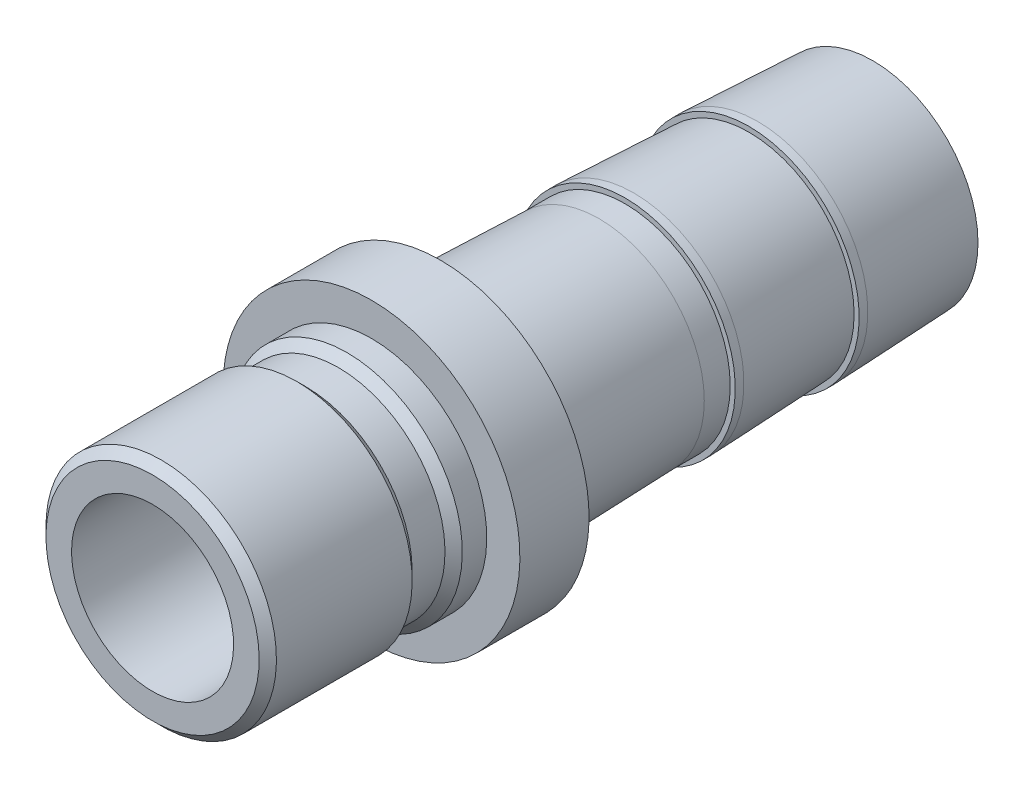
ISO-10303-21;
HEADER;
FILE_DESCRIPTION(('STEP AP214'),'2;1');
FILE_NAME('part.step','',(''),(''),'','','');
FILE_SCHEMA(('AUTOMOTIVE_DESIGN { 1 0 10303 214 1 1 1 1 }'));
ENDSEC;
DATA;
#1=APPLICATION_CONTEXT('core data for automotive mechanical design processes');
#2=APPLICATION_PROTOCOL_DEFINITION('international standard','automotive_design',2000,#1);
#3=PRODUCT_CONTEXT('',#1,'mechanical');
#4=PRODUCT('Part','Part','',(#3));
#5=PRODUCT_RELATED_PRODUCT_CATEGORY('part','',(#4));
#6=PRODUCT_DEFINITION_FORMATION('','',#4);
#7=PRODUCT_DEFINITION_CONTEXT('part definition',#1,'design');
#8=PRODUCT_DEFINITION('design','',#6,#7);
#9=PRODUCT_DEFINITION_SHAPE('','',#8);
#10=(LENGTH_UNIT() NAMED_UNIT(*) SI_UNIT(.MILLI.,.METRE.));
#11=(NAMED_UNIT(*) PLANE_ANGLE_UNIT() SI_UNIT($,.RADIAN.));
#12=(NAMED_UNIT(*) SI_UNIT($,.STERADIAN.) SOLID_ANGLE_UNIT());
#13=UNCERTAINTY_MEASURE_WITH_UNIT(LENGTH_MEASURE(1.E-05),#10,'distance_accuracy_value','');
#14=(GEOMETRIC_REPRESENTATION_CONTEXT(3) GLOBAL_UNCERTAINTY_ASSIGNED_CONTEXT((#13)) GLOBAL_UNIT_ASSIGNED_CONTEXT((#10,
#11,#12)) REPRESENTATION_CONTEXT('',''));
#15=CARTESIAN_POINT('',(0.,0.,0.));
#16=DIRECTION('',(0.,0.,1.));
#17=DIRECTION('',(1.,0.,0.));
#18=AXIS2_PLACEMENT_3D('',#15,#16,#17);
#19=CARTESIAN_POINT('',(0.,0.,0.));
#20=DIRECTION('',(0.,0.,-1.));
#21=DIRECTION('',(0.,1.,0.));
#22=AXIS2_PLACEMENT_3D('',#19,#20,#21);
#23=CYLINDRICAL_SURFACE('',#22,9.7155);
#24=CARTESIAN_POINT('',(0.,0.,-22.352));
#25=DIRECTION('',(0.,0.,-1.));
#26=DIRECTION('',(0.,1.,0.));
#27=AXIS2_PLACEMENT_3D('',#24,#25,#26);
#28=CIRCLE('',#27,9.7155);
#29=CARTESIAN_POINT('',(0.,9.7155,-22.352));
#30=VERTEX_POINT('',#29);
#31=EDGE_CURVE('E10',#30,#30,#28,.T.);
#32=ORIENTED_EDGE('',*,*,#31,.T.);
#33=EDGE_LOOP('',(#32));
#34=FACE_BOUND('',#33,.T.);
#35=CARTESIAN_POINT('',(0.,0.,-23.114));
#36=DIRECTION('',(0.,0.,-1.));
#37=DIRECTION('',(0.,1.,0.));
#38=AXIS2_PLACEMENT_3D('',#35,#36,#37);
#39=CIRCLE('',#38,9.7155);
#40=CARTESIAN_POINT('',(0.,9.7155,-23.114));
#41=VERTEX_POINT('',#40);
#42=EDGE_CURVE('E95',#41,#41,#39,.T.);
#43=ORIENTED_EDGE('',*,*,#42,.F.);
#44=EDGE_LOOP('',(#43));
#45=FACE_BOUND('',#44,.T.);
#46=ADVANCED_FACE('F31',(#34,#45),#23,.T.);
#47=CARTESIAN_POINT('',(0.,9.27099999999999,-22.352));
#48=DIRECTION('',(0.,0.,1.));
#49=DIRECTION('',(0.,-1.,0.));
#50=AXIS2_PLACEMENT_3D('',#47,#48,#49);
#51=PLANE('',#50);
#52=CARTESIAN_POINT('',(0.,0.,-22.352));
#53=DIRECTION('',(0.,0.,-1.));
#54=DIRECTION('',(0.,1.,0.));
#55=AXIS2_PLACEMENT_3D('',#52,#53,#54);
#56=CIRCLE('',#55,9.27099999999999);
#57=CARTESIAN_POINT('',(0.,9.27099999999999,-22.352));
#58=VERTEX_POINT('',#57);
#59=EDGE_CURVE('E37',#58,#58,#56,.T.);
#60=ORIENTED_EDGE('',*,*,#59,.T.);
#61=EDGE_LOOP('',(#60));
#62=FACE_BOUND('',#61,.T.);
#63=ORIENTED_EDGE('',*,*,#31,.F.);
#64=EDGE_LOOP('',(#63));
#65=FACE_BOUND('',#64,.T.);
#66=ADVANCED_FACE('F103',(#62,#65),#51,.T.);
#67=CARTESIAN_POINT('',(0.,0.,0.));
#68=DIRECTION('',(0.,0.,-1.));
#69=DIRECTION('',(0.,1.,0.));
#70=AXIS2_PLACEMENT_3D('',#67,#68,#69);
#71=CYLINDRICAL_SURFACE('',#70,9.27099999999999);
#72=CARTESIAN_POINT('',(0.,0.,-20.066));
#73=DIRECTION('',(0.,0.,-1.));
#74=DIRECTION('',(0.,1.,0.));
#75=AXIS2_PLACEMENT_3D('',#72,#73,#74);
#76=CIRCLE('',#75,9.27099999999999);
#77=CARTESIAN_POINT('',(0.,9.27099999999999,-20.066));
#78=VERTEX_POINT('',#77);
#79=EDGE_CURVE('E41',#78,#78,#76,.T.);
#80=ORIENTED_EDGE('',*,*,#79,.T.);
#81=EDGE_LOOP('',(#80));
#82=FACE_BOUND('',#81,.T.);
#83=ORIENTED_EDGE('',*,*,#59,.F.);
#84=EDGE_LOOP('',(#83));
#85=FACE_BOUND('',#84,.T.);
#86=ADVANCED_FACE('F107',(#82,#85),#71,.T.);
#87=CARTESIAN_POINT('',(0.,0.,-20.066));
#88=DIRECTION('',(0.,0.,1.));
#89=DIRECTION('',(0.,-1.,0.));
#90=AXIS2_PLACEMENT_3D('',#87,#88,#89);
#91=CONICAL_SURFACE('',#90,9.27099999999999,0.0318074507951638);
#92=CARTESIAN_POINT('',(0.,0.,-6.09600000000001));
#93=DIRECTION('',(0.,0.,-1.));
#94=DIRECTION('',(0.,1.,0.));
#95=AXIS2_PLACEMENT_3D('',#92,#93,#94);
#96=CIRCLE('',#95,9.7155);
#97=CARTESIAN_POINT('',(0.,9.7155,-6.096));
#98=VERTEX_POINT('',#97);
#99=EDGE_CURVE('E45',#98,#98,#96,.T.);
#100=ORIENTED_EDGE('',*,*,#99,.T.);
#101=EDGE_LOOP('',(#100));
#102=FACE_BOUND('',#101,.T.);
#103=ORIENTED_EDGE('',*,*,#79,.F.);
#104=EDGE_LOOP('',(#103));
#105=FACE_BOUND('',#104,.T.);
#106=ADVANCED_FACE('F111',(#102,#105),#91,.T.);
#107=CARTESIAN_POINT('',(0.,13.081,-6.096));
#108=DIRECTION('',(0.,0.,-1.));
#109=DIRECTION('',(0.,1.,0.));
#110=AXIS2_PLACEMENT_3D('',#107,#108,#109);
#111=PLANE('',#110);
#112=CARTESIAN_POINT('',(0.,0.,-6.09600000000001));
#113=DIRECTION('',(0.,0.,-1.));
#114=DIRECTION('',(0.,1.,0.));
#115=AXIS2_PLACEMENT_3D('',#112,#113,#114);
#116=CIRCLE('',#115,13.081);
#117=CARTESIAN_POINT('',(0.,13.081,-6.096));
#118=VERTEX_POINT('',#117);
#119=EDGE_CURVE('E50',#118,#118,#116,.T.);
#120=ORIENTED_EDGE('',*,*,#119,.T.);
#121=EDGE_LOOP('',(#120));
#122=FACE_BOUND('',#121,.T.);
#123=ORIENTED_EDGE('',*,*,#99,.F.);
#124=EDGE_LOOP('',(#123));
#125=FACE_BOUND('',#124,.T.);
#126=ADVANCED_FACE('F118',(#122,#125),#111,.T.);
#127=CARTESIAN_POINT('',(0.,0.,0.));
#128=DIRECTION('',(0.,0.,-1.));
#129=DIRECTION('',(0.,1.,0.));
#130=AXIS2_PLACEMENT_3D('',#127,#128,#129);
#131=CYLINDRICAL_SURFACE('',#130,13.081);
#132=CARTESIAN_POINT('',(0.,0.,0.));
#133=DIRECTION('',(0.,0.,-1.));
#134=DIRECTION('',(0.,1.,0.));
#135=AXIS2_PLACEMENT_3D('',#132,#133,#134);
#136=CIRCLE('',#135,13.081);
#137=CARTESIAN_POINT('',(0.,13.081,0.));
#138=VERTEX_POINT('',#137);
#139=EDGE_CURVE('E53',#138,#138,#136,.T.);
#140=ORIENTED_EDGE('',*,*,#139,.T.);
#141=EDGE_LOOP('',(#140));
#142=FACE_BOUND('',#141,.T.);
#143=ORIENTED_EDGE('',*,*,#119,.F.);
#144=EDGE_LOOP('',(#143));
#145=FACE_BOUND('',#144,.T.);
#146=ADVANCED_FACE('F122',(#142,#145),#131,.T.);
#147=CARTESIAN_POINT('',(0.,10.16,0.));
#148=DIRECTION('',(0.,0.,1.));
#149=DIRECTION('',(0.,-1.,0.));
#150=AXIS2_PLACEMENT_3D('',#147,#148,#149);
#151=PLANE('',#150);
#152=CARTESIAN_POINT('',(0.,0.,0.));
#153=DIRECTION('',(0.,0.,-1.));
#154=DIRECTION('',(0.,1.,0.));
#155=AXIS2_PLACEMENT_3D('',#152,#153,#154);
#156=CIRCLE('',#155,10.16);
#157=CARTESIAN_POINT('',(0.,10.16,0.));
#158=VERTEX_POINT('',#157);
#159=EDGE_CURVE('E56',#158,#158,#156,.T.);
#160=ORIENTED_EDGE('',*,*,#159,.T.);
#161=EDGE_LOOP('',(#160));
#162=FACE_BOUND('',#161,.T.);
#163=ORIENTED_EDGE('',*,*,#139,.F.);
#164=EDGE_LOOP('',(#163));
#165=FACE_BOUND('',#164,.T.);
#166=ADVANCED_FACE('F126',(#162,#165),#151,.T.);
#167=CARTESIAN_POINT('',(0.,0.,0.));
#168=DIRECTION('',(0.,0.,-1.));
#169=DIRECTION('',(0.,1.,0.));
#170=AXIS2_PLACEMENT_3D('',#167,#168,#169);
#171=CYLINDRICAL_SURFACE('',#170,10.16);
#172=CARTESIAN_POINT('',(0.,0.,2.15899999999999));
#173=DIRECTION('',(0.,0.,-1.));
#174=DIRECTION('',(0.,1.,0.));
#175=AXIS2_PLACEMENT_3D('',#172,#173,#174);
#176=CIRCLE('',#175,10.16);
#177=CARTESIAN_POINT('',(0.,10.16,2.15899999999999));
#178=VERTEX_POINT('',#177);
#179=EDGE_CURVE('E59',#178,#178,#176,.T.);
#180=ORIENTED_EDGE('',*,*,#179,.T.);
#181=EDGE_LOOP('',(#180));
#182=FACE_BOUND('',#181,.T.);
#183=ORIENTED_EDGE('',*,*,#159,.F.);
#184=EDGE_LOOP('',(#183));
#185=FACE_BOUND('',#184,.T.);
#186=ADVANCED_FACE('F130',(#182,#185),#171,.T.);
#187=CARTESIAN_POINT('',(0.,0.,2.15899999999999));
#188=DIRECTION('',(0.,0.,-1.));
#189=DIRECTION('',(0.,1.,0.));
#190=AXIS2_PLACEMENT_3D('',#187,#188,#189);
#191=CONICAL_SURFACE('',#190,10.16,0.785398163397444);
#192=CARTESIAN_POINT('',(0.,0.,2.921));
#193=DIRECTION('',(0.,0.,-1.));
#194=DIRECTION('',(0.,1.,0.));
#195=AXIS2_PLACEMENT_3D('',#192,#193,#194);
#196=CIRCLE('',#195,9.398);
#197=CARTESIAN_POINT('',(0.,9.398,2.921));
#198=VERTEX_POINT('',#197);
#199=EDGE_CURVE('E62',#198,#198,#196,.T.);
#200=ORIENTED_EDGE('',*,*,#199,.T.);
#201=EDGE_LOOP('',(#200));
#202=FACE_BOUND('',#201,.T.);
#203=ORIENTED_EDGE('',*,*,#179,.F.);
#204=EDGE_LOOP('',(#203));
#205=FACE_BOUND('',#204,.T.);
#206=ADVANCED_FACE('F134',(#202,#205),#191,.T.);
#207=CARTESIAN_POINT('',(0.,0.,0.));
#208=DIRECTION('',(0.,0.,-1.));
#209=DIRECTION('',(0.,1.,0.));
#210=AXIS2_PLACEMENT_3D('',#207,#208,#209);
#211=CYLINDRICAL_SURFACE('',#210,9.398);
#212=CARTESIAN_POINT('',(0.,0.,5.8166));
#213=DIRECTION('',(0.,0.,-1.));
#214=DIRECTION('',(0.,1.,0.));
#215=AXIS2_PLACEMENT_3D('',#212,#213,#214);
#216=CIRCLE('',#215,9.398);
#217=CARTESIAN_POINT('',(0.,9.398,5.8166));
#218=VERTEX_POINT('',#217);
#219=EDGE_CURVE('E65',#218,#218,#216,.T.);
#220=ORIENTED_EDGE('',*,*,#219,.T.);
#221=EDGE_LOOP('',(#220));
#222=FACE_BOUND('',#221,.T.);
#223=ORIENTED_EDGE('',*,*,#199,.F.);
#224=EDGE_LOOP('',(#223));
#225=FACE_BOUND('',#224,.T.);
#226=ADVANCED_FACE('F138',(#222,#225),#211,.T.);
#227=CARTESIAN_POINT('',(0.,0.,5.8166));
#228=DIRECTION('',(0.,0.,1.));
#229=DIRECTION('',(0.,-1.,0.));
#230=AXIS2_PLACEMENT_3D('',#227,#228,#229);
#231=CONICAL_SURFACE('',#230,9.398,0.785398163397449);
#232=CARTESIAN_POINT('',(0.,0.,6.5786));
#233=DIRECTION('',(0.,0.,-1.));
#234=DIRECTION('',(0.,1.,0.));
#235=AXIS2_PLACEMENT_3D('',#232,#233,#234);
#236=CIRCLE('',#235,10.16);
#237=CARTESIAN_POINT('',(0.,10.16,6.5786));
#238=VERTEX_POINT('',#237);
#239=EDGE_CURVE('E68',#238,#238,#236,.T.);
#240=ORIENTED_EDGE('',*,*,#239,.T.);
#241=EDGE_LOOP('',(#240));
#242=FACE_BOUND('',#241,.T.);
#243=ORIENTED_EDGE('',*,*,#219,.F.);
#244=EDGE_LOOP('',(#243));
#245=FACE_BOUND('',#244,.T.);
#246=ADVANCED_FACE('F142',(#242,#245),#231,.T.);
#247=CARTESIAN_POINT('',(0.,0.,0.));
#248=DIRECTION('',(0.,0.,-1.));
#249=DIRECTION('',(0.,1.,0.));
#250=AXIS2_PLACEMENT_3D('',#247,#248,#249);
#251=CYLINDRICAL_SURFACE('',#250,10.16);
#252=CARTESIAN_POINT('',(0.,0.,18.542));
#253=DIRECTION('',(0.,0.,-1.));
#254=DIRECTION('',(0.,1.,0.));
#255=AXIS2_PLACEMENT_3D('',#252,#253,#254);
#256=CIRCLE('',#255,10.16);
#257=CARTESIAN_POINT('',(0.,10.16,18.542));
#258=VERTEX_POINT('',#257);
#259=EDGE_CURVE('E71',#258,#258,#256,.T.);
#260=ORIENTED_EDGE('',*,*,#259,.T.);
#261=EDGE_LOOP('',(#260));
#262=FACE_BOUND('',#261,.T.);
#263=ORIENTED_EDGE('',*,*,#239,.F.);
#264=EDGE_LOOP('',(#263));
#265=FACE_BOUND('',#264,.T.);
#266=ADVANCED_FACE('F146',(#262,#265),#251,.T.);
#267=CARTESIAN_POINT('',(0.,0.,18.542));
#268=DIRECTION('',(0.,0.,-1.));
#269=DIRECTION('',(0.,1.,0.));
#270=AXIS2_PLACEMENT_3D('',#267,#268,#269);
#271=CONICAL_SURFACE('',#270,10.16,0.785398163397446);
#272=CARTESIAN_POINT('',(0.,0.,19.304));
#273=DIRECTION('',(0.,0.,-1.));
#274=DIRECTION('',(0.,1.,0.));
#275=AXIS2_PLACEMENT_3D('',#272,#273,#274);
#276=CIRCLE('',#275,9.398);
#277=CARTESIAN_POINT('',(0.,9.398,19.304));
#278=VERTEX_POINT('',#277);
#279=EDGE_CURVE('E74',#278,#278,#276,.T.);
#280=ORIENTED_EDGE('',*,*,#279,.T.);
#281=EDGE_LOOP('',(#280));
#282=FACE_BOUND('',#281,.T.);
#283=ORIENTED_EDGE('',*,*,#259,.F.);
#284=EDGE_LOOP('',(#283));
#285=FACE_BOUND('',#284,.T.);
#286=ADVANCED_FACE('F150',(#282,#285),#271,.T.);
#287=CARTESIAN_POINT('',(0.,7.14375,19.304));
#288=DIRECTION('',(0.,0.,1.));
#289=DIRECTION('',(0.,-1.,0.));
#290=AXIS2_PLACEMENT_3D('',#287,#288,#289);
#291=PLANE('',#290);
#292=CARTESIAN_POINT('',(0.,0.,19.304));
#293=DIRECTION('',(0.,0.,-1.));
#294=DIRECTION('',(0.,1.,0.));
#295=AXIS2_PLACEMENT_3D('',#292,#293,#294);
#296=CIRCLE('',#295,7.14375);
#297=CARTESIAN_POINT('',(0.,7.14375,19.304));
#298=VERTEX_POINT('',#297);
#299=EDGE_CURVE('E77',#298,#298,#296,.T.);
#300=ORIENTED_EDGE('',*,*,#299,.T.);
#301=EDGE_LOOP('',(#300));
#302=FACE_BOUND('',#301,.T.);
#303=ORIENTED_EDGE('',*,*,#279,.F.);
#304=EDGE_LOOP('',(#303));
#305=FACE_BOUND('',#304,.T.);
#306=ADVANCED_FACE('F154',(#302,#305),#291,.T.);
#307=CARTESIAN_POINT('',(0.,0.,0.));
#308=DIRECTION('',(0.,0.,-1.));
#309=DIRECTION('',(0.,1.,0.));
#310=AXIS2_PLACEMENT_3D('',#307,#308,#309);
#311=CYLINDRICAL_SURFACE('',#310,7.14375);
#312=CARTESIAN_POINT('',(0.,0.,-44.196));
#313=DIRECTION('',(0.,0.,-1.));
#314=DIRECTION('',(0.,1.,0.));
#315=AXIS2_PLACEMENT_3D('',#312,#313,#314);
#316=CIRCLE('',#315,7.14374999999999);
#317=CARTESIAN_POINT('',(0.,7.14375,-44.196));
#318=VERTEX_POINT('',#317);
#319=EDGE_CURVE('E80',#318,#318,#316,.T.);
#320=ORIENTED_EDGE('',*,*,#319,.T.);
#321=EDGE_LOOP('',(#320));
#322=FACE_BOUND('',#321,.T.);
#323=ORIENTED_EDGE('',*,*,#299,.F.);
#324=EDGE_LOOP('',(#323));
#325=FACE_BOUND('',#324,.T.);
#326=ADVANCED_FACE('F158',(#322,#325),#311,.F.);
#327=CARTESIAN_POINT('',(0.,9.271,-44.196));
#328=DIRECTION('',(0.,0.,-1.));
#329=DIRECTION('',(0.,1.,0.));
#330=AXIS2_PLACEMENT_3D('',#327,#328,#329);
#331=PLANE('',#330);
#332=CARTESIAN_POINT('',(0.,0.,-44.196));
#333=DIRECTION('',(0.,0.,-1.));
#334=DIRECTION('',(0.,1.,0.));
#335=AXIS2_PLACEMENT_3D('',#332,#333,#334);
#336=CIRCLE('',#335,9.27099999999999);
#337=CARTESIAN_POINT('',(0.,9.271,-44.196));
#338=VERTEX_POINT('',#337);
#339=EDGE_CURVE('E83',#338,#338,#336,.T.);
#340=ORIENTED_EDGE('',*,*,#339,.T.);
#341=EDGE_LOOP('',(#340));
#342=FACE_BOUND('',#341,.T.);
#343=ORIENTED_EDGE('',*,*,#319,.F.);
#344=EDGE_LOOP('',(#343));
#345=FACE_BOUND('',#344,.T.);
#346=ADVANCED_FACE('F162',(#342,#345),#331,.T.);
#347=CARTESIAN_POINT('',(0.,0.,-44.196));
#348=DIRECTION('',(0.,0.,1.));
#349=DIRECTION('',(0.,-1.,0.));
#350=AXIS2_PLACEMENT_3D('',#347,#348,#349);
#351=CONICAL_SURFACE('',#350,9.27099999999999,0.0437221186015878);
#352=CARTESIAN_POINT('',(0.,0.,-34.036));
#353=DIRECTION('',(0.,0.,-1.));
#354=DIRECTION('',(0.,1.,0.));
#355=AXIS2_PLACEMENT_3D('',#352,#353,#354);
#356=CIRCLE('',#355,9.7155);
#357=CARTESIAN_POINT('',(0.,9.7155,-34.036));
#358=VERTEX_POINT('',#357);
#359=EDGE_CURVE('E86',#358,#358,#356,.T.);
#360=ORIENTED_EDGE('',*,*,#359,.T.);
#361=EDGE_LOOP('',(#360));
#362=FACE_BOUND('',#361,.T.);
#363=ORIENTED_EDGE('',*,*,#339,.F.);
#364=EDGE_LOOP('',(#363));
#365=FACE_BOUND('',#364,.T.);
#366=ADVANCED_FACE('F166',(#362,#365),#351,.T.);
#367=CARTESIAN_POINT('',(0.,0.,0.));
#368=DIRECTION('',(0.,0.,-1.));
#369=DIRECTION('',(0.,1.,0.));
#370=AXIS2_PLACEMENT_3D('',#367,#368,#369);
#371=CYLINDRICAL_SURFACE('',#370,9.7155);
#372=CARTESIAN_POINT('',(0.,0.,-33.274));
#373=DIRECTION('',(0.,0.,-1.));
#374=DIRECTION('',(0.,1.,0.));
#375=AXIS2_PLACEMENT_3D('',#372,#373,#374);
#376=CIRCLE('',#375,9.7155);
#377=CARTESIAN_POINT('',(0.,9.7155,-33.274));
#378=VERTEX_POINT('',#377);
#379=EDGE_CURVE('E89',#378,#378,#376,.T.);
#380=ORIENTED_EDGE('',*,*,#379,.T.);
#381=EDGE_LOOP('',(#380));
#382=FACE_BOUND('',#381,.T.);
#383=ORIENTED_EDGE('',*,*,#359,.F.);
#384=EDGE_LOOP('',(#383));
#385=FACE_BOUND('',#384,.T.);
#386=ADVANCED_FACE('F170',(#382,#385),#371,.T.);
#387=CARTESIAN_POINT('',(0.,9.27099999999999,-33.274));
#388=DIRECTION('',(0.,0.,1.));
#389=DIRECTION('',(0.,-1.,0.));
#390=AXIS2_PLACEMENT_3D('',#387,#388,#389);
#391=PLANE('',#390);
#392=CARTESIAN_POINT('',(0.,0.,-33.274));
#393=DIRECTION('',(0.,0.,-1.));
#394=DIRECTION('',(0.,1.,0.));
#395=AXIS2_PLACEMENT_3D('',#392,#393,#394);
#396=CIRCLE('',#395,9.27099999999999);
#397=CARTESIAN_POINT('',(0.,9.27099999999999,-33.274));
#398=VERTEX_POINT('',#397);
#399=EDGE_CURVE('E92',#398,#398,#396,.T.);
#400=ORIENTED_EDGE('',*,*,#399,.T.);
#401=EDGE_LOOP('',(#400));
#402=FACE_BOUND('',#401,.T.);
#403=ORIENTED_EDGE('',*,*,#379,.F.);
#404=EDGE_LOOP('',(#403));
#405=FACE_BOUND('',#404,.T.);
#406=ADVANCED_FACE('F174',(#402,#405),#391,.T.);
#407=CARTESIAN_POINT('',(0.,0.,-33.274));
#408=DIRECTION('',(0.,0.,1.));
#409=DIRECTION('',(0.,-1.,0.));
#410=AXIS2_PLACEMENT_3D('',#407,#408,#409);
#411=CONICAL_SURFACE('',#410,9.27099999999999,0.0437221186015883);
#412=ORIENTED_EDGE('',*,*,#42,.T.);
#413=EDGE_LOOP('',(#412));
#414=FACE_BOUND('',#413,.T.);
#415=ORIENTED_EDGE('',*,*,#399,.F.);
#416=EDGE_LOOP('',(#415));
#417=FACE_BOUND('',#416,.T.);
#418=ADVANCED_FACE('F99',(#414,#417),#411,.T.);
#419=CLOSED_SHELL('',(#46,#66,#86,#106,#126,#146,#166,#186,#206,#226,#246,#266,#286,#306,#326,
#346,#366,#386,#406,#418));
#420=MANIFOLD_SOLID_BREP('B2',#419);
#421=ADVANCED_BREP_SHAPE_REPRESENTATION('',(#18,#420),#14);
#422=SHAPE_DEFINITION_REPRESENTATION(#9,#421);
ENDSEC;
END-ISO-10303-21;
